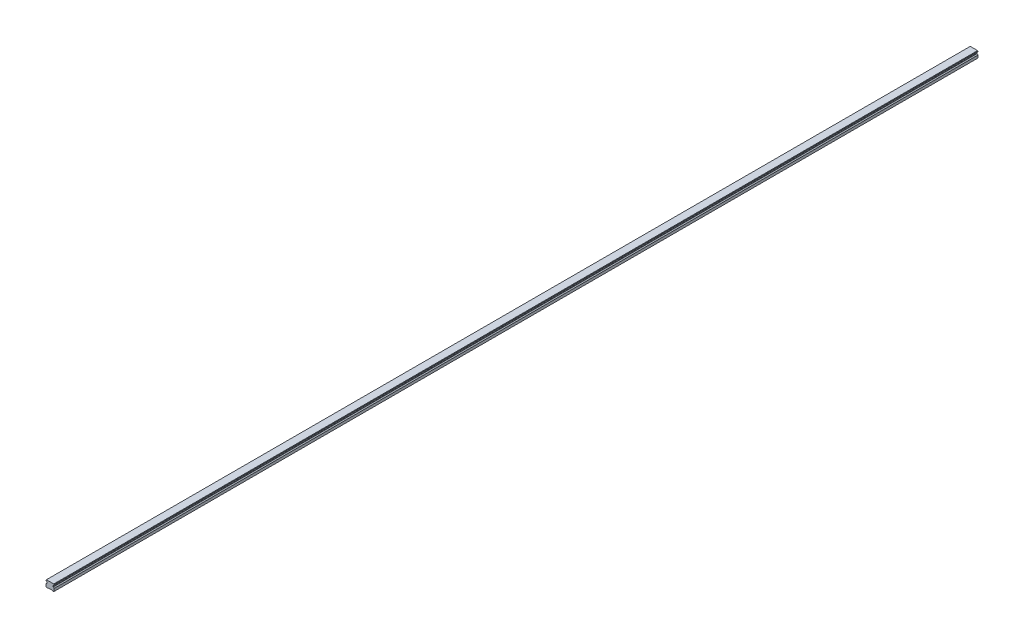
from build123d import *

# Parameters (mm, degrees)
SKETCH1_W           = 20
SKETCH1_H           = 16.3
BOSS_EXTRUDE1_DEPTH = 1130
CUT_EXTRUDE1_DEPTH  = 2261.080903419
CHAMFER1_SIZE       = 1
FILLET1_R           = 1
CUT_EXTRUDE2_DEPTH  = 2261.080903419
SKETCH5_R           = 3
SKETCH5_R_2         = 2.5
CUT_EXTRUDE5_DEPTH  = 10
SKETCH5_2_R         = 2.5
CUT_EXTRUDE6_DEPTH  = 13
LPATTERN2_COUNT     = 38
LPATTERN2_PITCH     = 60


with BuildPart() as part:
    # Sketch1 → Boss-Extrude1 (new, symmetric)
    with BuildSketch(Plane.XY):
        with Locations((0, 8.15)):
            Rectangle(SKETCH1_W, SKETCH1_H)
    extrude(amount=BOSS_EXTRUDE1_DEPTH, both=True)

    # Sketch2 → Cut-Extrude1 (cut, through all)
    with BuildSketch(Plane.XY.offset(1130)):
        Polygon((-10, 14.3), (-10, 7.3), (-7.666666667, 9.633333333), (-7.666666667, 11.966666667), align=None)
        Polygon((7.666666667, 11.966666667), (10, 14.3), (10, 7.3), (7.666666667, 9.633333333), align=None)
    extrude(amount=-CUT_EXTRUDE1_DEPTH, mode=Mode.SUBTRACT)

    # Chamfer1
    chamfer1_edges = [part.edges().sort_by_distance(p)[0] for p in [
        (-10, 16.3, 0),
        (10, 16.3, 0),
        (10, 0, 0),
        (-10, 0, 0),
    ]]
    chamfer(chamfer1_edges, length=CHAMFER1_SIZE)

    # Fillet1
    fillet1_edges = [part.edges().sort_by_distance(p)[0] for p in [
        (-7.666666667, 11.966666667, 0),
        (-7.666666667, 9.633333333, 0),
        (7.666666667, 9.633333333, 0),
        (7.666666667, 11.966666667, 0),
    ]]
    fillet(fillet1_edges, radius=FILLET1_R)

    # Sketch3 → Cut-Extrude2 (cut, through all)
    with BuildSketch(Plane.XY.offset(1130)):
        Polygon((-6, 0), (-5, 1), (5, 1), (6, 0), align=None)
    extrude(amount=-CUT_EXTRUDE2_DEPTH, mode=Mode.SUBTRACT)

    # Sketch5 → Cut-Extrude5 (cut)
    with BuildSketch(Plane.XZ.offset(-1)):
        with Locations(Location((0, 1110, 0), (0, 0, 270))):
            Circle(SKETCH5_R)
        with Locations(Location((0, 1110, 0), (0, 0, 270))):
            Circle(SKETCH5_R_2, mode=Mode.SUBTRACT)
    cut_extrude5 = extrude(amount=-CUT_EXTRUDE5_DEPTH, mode=Mode.SUBTRACT)

    # Sketch5_2 → Cut-Extrude6 (cut)
    with BuildSketch(Plane.XZ.offset(-1)):
        with Locations(Location((0, 1110, 0), (0, 0, 270))):
            Circle(SKETCH5_2_R)
    cut_extrude6 = extrude(amount=-CUT_EXTRUDE6_DEPTH, mode=Mode.SUBTRACT)

    # Cut-Extrude7 cone 1 section (on through the dimple's axis) → Cut-Extrude7 (revolve, cut)
    with BuildSketch(Plane(origin=(0, 14, 1110), x_dir=(0, 0, -1), z_dir=(1, 0, 0))):
        Polygon((0, 0), (2.5, 0), (0, 1.443375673), align=None)
    cut_extrude7 = revolve(axis=Axis((0, 14, 1110), (0, 1, 0)), mode=Mode.SUBTRACT)

    # LPattern2: Cut-Extrude5, Cut-Extrude6, Cut-Extrude7 ×38
    with Locations(*[(0, 0, -i * LPATTERN2_PITCH) for i in range(1, LPATTERN2_COUNT)]):
        add(cut_extrude5, mode=Mode.SUBTRACT)
        add(cut_extrude6, mode=Mode.SUBTRACT)
        add(cut_extrude7, mode=Mode.SUBTRACT)


solid = part.part
